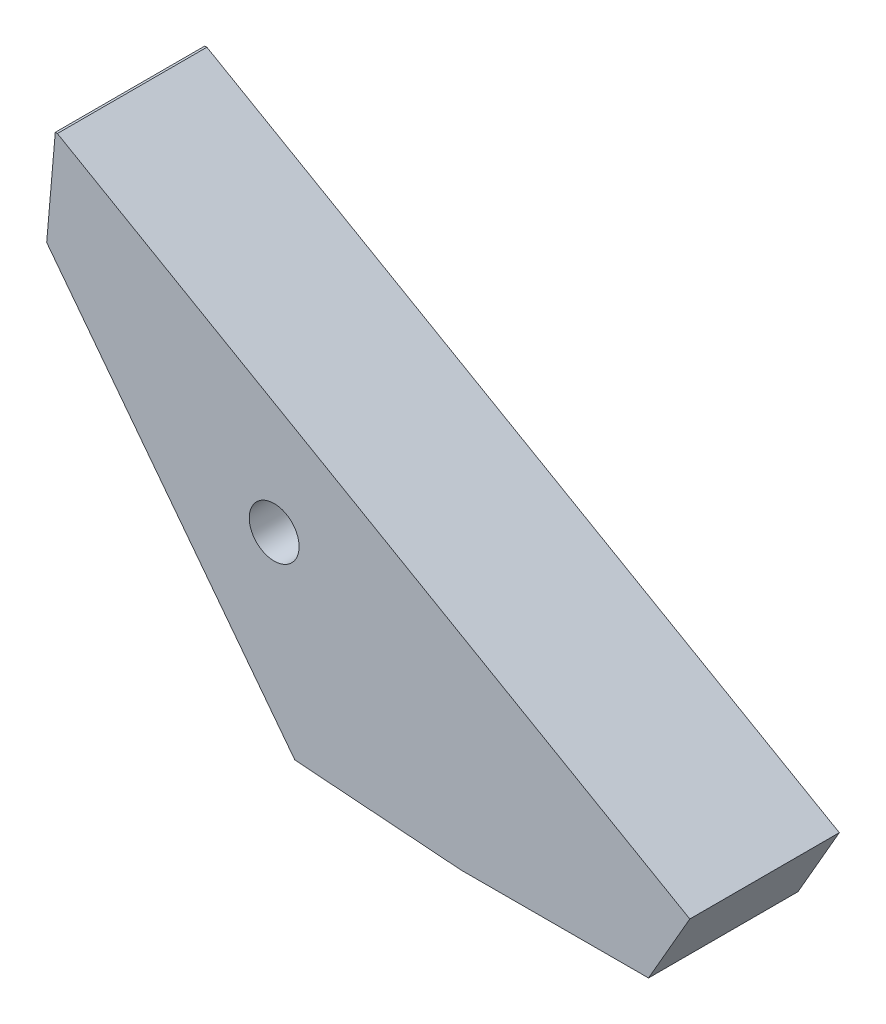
ISO-10303-21;
HEADER;
FILE_DESCRIPTION(('STEP AP214'),'2;1');
FILE_NAME('part.step','',(''),(''),'','','');
FILE_SCHEMA(('AUTOMOTIVE_DESIGN { 1 0 10303 214 1 1 1 1 }'));
ENDSEC;
DATA;
#1=APPLICATION_CONTEXT('core data for automotive mechanical design processes');
#2=APPLICATION_PROTOCOL_DEFINITION('international standard','automotive_design',2000,#1);
#3=PRODUCT_CONTEXT('',#1,'mechanical');
#4=PRODUCT('Part','Part','',(#3));
#5=PRODUCT_RELATED_PRODUCT_CATEGORY('part','',(#4));
#6=PRODUCT_DEFINITION_FORMATION('','',#4);
#7=PRODUCT_DEFINITION_CONTEXT('part definition',#1,'design');
#8=PRODUCT_DEFINITION('design','',#6,#7);
#9=PRODUCT_DEFINITION_SHAPE('','',#8);
#10=(LENGTH_UNIT() NAMED_UNIT(*) SI_UNIT(.MILLI.,.METRE.));
#11=(NAMED_UNIT(*) PLANE_ANGLE_UNIT() SI_UNIT($,.RADIAN.));
#12=(NAMED_UNIT(*) SI_UNIT($,.STERADIAN.) SOLID_ANGLE_UNIT());
#13=UNCERTAINTY_MEASURE_WITH_UNIT(LENGTH_MEASURE(1.E-05),#10,'distance_accuracy_value','');
#14=(GEOMETRIC_REPRESENTATION_CONTEXT(3) GLOBAL_UNCERTAINTY_ASSIGNED_CONTEXT((#13)) GLOBAL_UNIT_ASSIGNED_CONTEXT((#10,
#11,#12)) REPRESENTATION_CONTEXT('',''));
#15=CARTESIAN_POINT('',(0.,0.,0.));
#16=DIRECTION('',(0.,0.,1.));
#17=DIRECTION('',(1.,0.,0.));
#18=AXIS2_PLACEMENT_3D('',#15,#16,#17);
#19=CARTESIAN_POINT('',(-87.8467703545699,95.0748547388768,-30.));
#20=DIRECTION('',(0.,1.,0.));
#21=DIRECTION('',(0.,0.,1.));
#22=AXIS2_PLACEMENT_3D('',#19,#20,#21);
#23=PLANE('',#22);
#24=DIRECTION('',(0.,0.,1.));
#25=VECTOR('',#24,1.);
#26=CARTESIAN_POINT('',(-87.8467703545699,95.0748547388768,-30.));
#27=LINE('',#26,#25);
#28=CARTESIAN_POINT('',(-87.8467703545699,95.0748547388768,-30.));
#29=VERTEX_POINT('',#28);
#30=CARTESIAN_POINT('',(-87.8467703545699,95.0748547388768,30.));
#31=VERTEX_POINT('',#30);
#32=EDGE_CURVE('E34',#29,#31,#27,.T.);
#33=ORIENTED_EDGE('',*,*,#32,.T.);
#34=DIRECTION('',(-1.,0.,0.));
#35=VECTOR('',#34,1.);
#36=CARTESIAN_POINT('',(-87.8467703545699,95.0748547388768,30.));
#37=LINE('',#36,#35);
#38=CARTESIAN_POINT('',(-87.0060329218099,95.0748547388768,30.));
#39=VERTEX_POINT('',#38);
#40=EDGE_CURVE('E89',#39,#31,#37,.T.);
#41=ORIENTED_EDGE('',*,*,#40,.F.);
#42=DIRECTION('',(0.,0.,1.));
#43=VECTOR('',#42,1.);
#44=CARTESIAN_POINT('',(-87.0060329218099,95.0748547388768,-30.));
#45=LINE('',#44,#43);
#46=CARTESIAN_POINT('',(-87.0060329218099,95.0748547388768,-30.));
#47=VERTEX_POINT('',#46);
#48=EDGE_CURVE('E11',#47,#39,#45,.T.);
#49=ORIENTED_EDGE('',*,*,#48,.F.);
#50=DIRECTION('',(-1.,0.,0.));
#51=VECTOR('',#50,1.);
#52=CARTESIAN_POINT('',(-87.8467703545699,95.0748547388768,-30.));
#53=LINE('',#52,#51);
#54=EDGE_CURVE('E90',#47,#29,#53,.T.);
#55=ORIENTED_EDGE('',*,*,#54,.T.);
#56=EDGE_LOOP('',(#33,#41,#49,#55));
#57=FACE_BOUND('',#56,.T.);
#58=ADVANCED_FACE('F31',(#57),#23,.T.);
#59=CARTESIAN_POINT('',(-87.0060329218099,95.0748547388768,-30.));
#60=DIRECTION('',(0.49883100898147,0.866699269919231,0.));
#61=DIRECTION('',(-0.866699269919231,0.49883100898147,0.));
#62=AXIS2_PLACEMENT_3D('',#59,#60,#61);
#63=PLANE('',#62);
#64=ORIENTED_EDGE('',*,*,#48,.T.);
#65=DIRECTION('',(-0.866699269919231,0.49883100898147,0.));
#66=VECTOR('',#65,1.);
#67=CARTESIAN_POINT('',(-87.0060329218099,95.0748547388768,30.));
#68=LINE('',#67,#66);
#69=CARTESIAN_POINT('',(166.793285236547,-51.,30.));
#70=VERTEX_POINT('',#69);
#71=EDGE_CURVE('E108',#70,#39,#68,.T.);
#72=ORIENTED_EDGE('',*,*,#71,.F.);
#73=DIRECTION('',(0.,0.,1.));
#74=VECTOR('',#73,1.);
#75=CARTESIAN_POINT('',(166.793285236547,-51.,-30.));
#76=LINE('',#75,#74);
#77=CARTESIAN_POINT('',(166.793285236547,-51.,-30.));
#78=VERTEX_POINT('',#77);
#79=EDGE_CURVE('E39',#78,#70,#76,.T.);
#80=ORIENTED_EDGE('',*,*,#79,.F.);
#81=DIRECTION('',(-0.866699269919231,0.49883100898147,0.));
#82=VECTOR('',#81,1.);
#83=CARTESIAN_POINT('',(-87.0060329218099,95.0748547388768,-30.));
#84=LINE('',#83,#82);
#85=EDGE_CURVE('E94',#78,#47,#84,.T.);
#86=ORIENTED_EDGE('',*,*,#85,.T.);
#87=EDGE_LOOP('',(#64,#72,#80,#86));
#88=FACE_BOUND('',#87,.T.);
#89=ADVANCED_FACE('F166',(#88),#63,.T.);
#90=CARTESIAN_POINT('',(166.793285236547,-51.,-30.));
#91=DIRECTION('',(0.866699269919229,-0.498831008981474,0.));
#92=DIRECTION('',(0.498831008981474,0.866699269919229,0.));
#93=AXIS2_PLACEMENT_3D('',#90,#91,#92);
#94=PLANE('',#93);
#95=ORIENTED_EDGE('',*,*,#79,.T.);
#96=DIRECTION('',(0.498831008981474,0.866699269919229,0.));
#97=VECTOR('',#96,1.);
#98=CARTESIAN_POINT('',(166.793285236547,-51.,30.));
#99=LINE('',#98,#97);
#100=CARTESIAN_POINT('',(150.218878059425,-79.7973809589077,30.));
#101=VERTEX_POINT('',#100);
#102=EDGE_CURVE('E121',#101,#70,#99,.T.);
#103=ORIENTED_EDGE('',*,*,#102,.F.);
#104=DIRECTION('',(0.,0.,1.));
#105=VECTOR('',#104,1.);
#106=CARTESIAN_POINT('',(150.218878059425,-79.7973809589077,-30.));
#107=LINE('',#106,#105);
#108=CARTESIAN_POINT('',(150.218878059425,-79.7973809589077,-30.));
#109=VERTEX_POINT('',#108);
#110=EDGE_CURVE('E143',#109,#101,#107,.T.);
#111=ORIENTED_EDGE('',*,*,#110,.F.);
#112=DIRECTION('',(0.498831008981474,0.866699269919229,0.));
#113=VECTOR('',#112,1.);
#114=CARTESIAN_POINT('',(166.793285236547,-51.,-30.));
#115=LINE('',#114,#113);
#116=EDGE_CURVE('E139',#109,#78,#115,.T.);
#117=ORIENTED_EDGE('',*,*,#116,.T.);
#118=EDGE_LOOP('',(#95,#103,#111,#117));
#119=FACE_BOUND('',#118,.T.);
#120=ADVANCED_FACE('F164',(#119),#94,.T.);
#121=CARTESIAN_POINT('',(150.218878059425,-79.7973809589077,-30.));
#122=DIRECTION('',(0.0013493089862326,-0.999999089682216,0.));
#123=DIRECTION('',(0.999999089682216,0.0013493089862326,0.));
#124=AXIS2_PLACEMENT_3D('',#121,#122,#123);
#125=PLANE('',#124);
#126=ORIENTED_EDGE('',*,*,#110,.T.);
#127=DIRECTION('',(0.999999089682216,0.0013493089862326,0.));
#128=VECTOR('',#127,1.);
#129=CARTESIAN_POINT('',(150.218878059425,-79.7973809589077,30.));
#130=LINE('',#129,#128);
#131=CARTESIAN_POINT('',(75.,-79.898874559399,30.));
#132=VERTEX_POINT('',#131);
#133=EDGE_CURVE('E118',#132,#101,#130,.T.);
#134=ORIENTED_EDGE('',*,*,#133,.F.);
#135=DIRECTION('',(0.,0.,1.));
#136=VECTOR('',#135,1.);
#137=CARTESIAN_POINT('',(75.,-79.898874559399,-30.));
#138=LINE('',#137,#136);
#139=CARTESIAN_POINT('',(75.,-79.898874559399,-30.));
#140=VERTEX_POINT('',#139);
#141=EDGE_CURVE('E145',#140,#132,#138,.T.);
#142=ORIENTED_EDGE('',*,*,#141,.F.);
#143=DIRECTION('',(0.999999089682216,0.0013493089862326,0.));
#144=VECTOR('',#143,1.);
#145=CARTESIAN_POINT('',(150.218878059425,-79.7973809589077,-30.));
#146=LINE('',#145,#144);
#147=EDGE_CURVE('E136',#140,#109,#146,.T.);
#148=ORIENTED_EDGE('',*,*,#147,.T.);
#149=EDGE_LOOP('',(#126,#134,#142,#148));
#150=FACE_BOUND('',#149,.T.);
#151=ADVANCED_FACE('F158',(#150),#125,.T.);
#152=CARTESIAN_POINT('',(8.30000000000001,-74.9888689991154,-30.));
#153=DIRECTION('',(-0.0734146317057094,-0.997301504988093,0.));
#154=DIRECTION('',(0.997301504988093,-0.0734146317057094,0.));
#155=AXIS2_PLACEMENT_3D('',#152,#153,#154);
#156=PLANE('',#155);
#157=ORIENTED_EDGE('',*,*,#141,.T.);
#158=DIRECTION('',(0.997301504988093,-0.0734146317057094,0.));
#159=VECTOR('',#158,1.);
#160=CARTESIAN_POINT('',(8.30000000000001,-74.9888689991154,30.));
#161=LINE('',#160,#159);
#162=CARTESIAN_POINT('',(8.30000000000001,-74.9888689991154,30.));
#163=VERTEX_POINT('',#162);
#164=EDGE_CURVE('E115',#163,#132,#161,.T.);
#165=ORIENTED_EDGE('',*,*,#164,.F.);
#166=DIRECTION('',(0.,0.,1.));
#167=VECTOR('',#166,1.);
#168=CARTESIAN_POINT('',(8.30000000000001,-74.9888689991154,-30.));
#169=LINE('',#168,#167);
#170=CARTESIAN_POINT('',(8.30000000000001,-74.9888689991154,-30.));
#171=VERTEX_POINT('',#170);
#172=EDGE_CURVE('E147',#171,#163,#169,.T.);
#173=ORIENTED_EDGE('',*,*,#172,.F.);
#174=DIRECTION('',(0.997301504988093,-0.0734146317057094,0.));
#175=VECTOR('',#174,1.);
#176=CARTESIAN_POINT('',(8.30000000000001,-74.9888689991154,-30.));
#177=LINE('',#176,#175);
#178=EDGE_CURVE('E133',#171,#140,#177,.T.);
#179=ORIENTED_EDGE('',*,*,#178,.T.);
#180=EDGE_LOOP('',(#157,#165,#173,#179));
#181=FACE_BOUND('',#180,.T.);
#182=ADVANCED_FACE('F155',(#181),#156,.T.);
#183=CARTESIAN_POINT('',(-91.2919377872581,55.0748547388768,-30.));
#184=DIRECTION('',(-0.7939704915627,-0.607956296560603,0.));
#185=DIRECTION('',(0.607956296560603,-0.7939704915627,0.));
#186=AXIS2_PLACEMENT_3D('',#183,#184,#185);
#187=PLANE('',#186);
#188=ORIENTED_EDGE('',*,*,#172,.T.);
#189=DIRECTION('',(0.607956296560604,-0.7939704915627,0.));
#190=VECTOR('',#189,1.);
#191=CARTESIAN_POINT('',(-91.2919377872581,55.0748547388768,30.));
#192=LINE('',#191,#190);
#193=CARTESIAN_POINT('',(-91.2919377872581,55.0748547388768,30.));
#194=VERTEX_POINT('',#193);
#195=EDGE_CURVE('E102',#194,#163,#192,.T.);
#196=ORIENTED_EDGE('',*,*,#195,.F.);
#197=DIRECTION('',(0.,0.,1.));
#198=VECTOR('',#197,1.);
#199=CARTESIAN_POINT('',(-91.2919377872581,55.0748547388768,-30.));
#200=LINE('',#199,#198);
#201=CARTESIAN_POINT('',(-91.2919377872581,55.0748547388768,-30.));
#202=VERTEX_POINT('',#201);
#203=EDGE_CURVE('E93',#202,#194,#200,.T.);
#204=ORIENTED_EDGE('',*,*,#203,.F.);
#205=DIRECTION('',(0.607956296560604,-0.7939704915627,0.));
#206=VECTOR('',#205,1.);
#207=CARTESIAN_POINT('',(-91.2919377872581,55.0748547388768,-30.));
#208=LINE('',#207,#206);
#209=EDGE_CURVE('E130',#202,#171,#208,.T.);
#210=ORIENTED_EDGE('',*,*,#209,.T.);
#211=EDGE_LOOP('',(#188,#196,#204,#210));
#212=FACE_BOUND('',#211,.T.);
#213=ADVANCED_FACE('F149',(#212),#187,.T.);
#214=CARTESIAN_POINT('',(-91.2919377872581,55.0748547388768,-30.));
#215=DIRECTION('',(-0.996311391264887,0.0858114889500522,0.));
#216=DIRECTION('',(-0.0858114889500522,-0.996311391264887,0.));
#217=AXIS2_PLACEMENT_3D('',#214,#215,#216);
#218=PLANE('',#217);
#219=ORIENTED_EDGE('',*,*,#203,.T.);
#220=DIRECTION('',(-0.0858114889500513,-0.996311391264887,0.));
#221=VECTOR('',#220,1.);
#222=CARTESIAN_POINT('',(-90.,70.0748547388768,30.));
#223=LINE('',#222,#221);
#224=EDGE_CURVE('E96',#31,#194,#223,.T.);
#225=ORIENTED_EDGE('',*,*,#224,.F.);
#226=ORIENTED_EDGE('',*,*,#32,.F.);
#227=DIRECTION('',(-0.0858114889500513,-0.996311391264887,0.));
#228=VECTOR('',#227,1.);
#229=CARTESIAN_POINT('',(-90.,70.0748547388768,-30.));
#230=LINE('',#229,#228);
#231=EDGE_CURVE('E128',#29,#202,#230,.T.);
#232=ORIENTED_EDGE('',*,*,#231,.T.);
#233=EDGE_LOOP('',(#219,#225,#226,#232));
#234=FACE_BOUND('',#233,.T.);
#235=ADVANCED_FACE('F97',(#234),#218,.T.);
#236=CARTESIAN_POINT('',(-87.8467703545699,95.0748547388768,-30.));
#237=DIRECTION('',(0.,0.,1.));
#238=DIRECTION('',(1.,0.,0.));
#239=AXIS2_PLACEMENT_3D('',#236,#237,#238);
#240=PLANE('',#239);
#241=CARTESIAN_POINT('',(0.,0.,-30.));
#242=DIRECTION('',(0.,0.,1.));
#243=DIRECTION('',(1.,0.,0.));
#244=AXIS2_PLACEMENT_3D('',#241,#242,#243);
#245=CIRCLE('',#244,10.);
#246=CARTESIAN_POINT('',(10.,0.,-30.));
#247=VERTEX_POINT('',#246);
#248=EDGE_CURVE('E124',#247,#247,#245,.T.);
#249=ORIENTED_EDGE('',*,*,#248,.T.);
#250=EDGE_LOOP('',(#249));
#251=FACE_BOUND('',#250,.T.);
#252=ORIENTED_EDGE('',*,*,#54,.F.);
#253=ORIENTED_EDGE('',*,*,#85,.F.);
#254=ORIENTED_EDGE('',*,*,#116,.F.);
#255=ORIENTED_EDGE('',*,*,#147,.F.);
#256=ORIENTED_EDGE('',*,*,#178,.F.);
#257=ORIENTED_EDGE('',*,*,#209,.F.);
#258=ORIENTED_EDGE('',*,*,#231,.F.);
#259=EDGE_LOOP('',(#252,#253,#254,#255,#256,#257,#258));
#260=FACE_BOUND('',#259,.T.);
#261=ADVANCED_FACE('F161',(#251,#260),#240,.F.);
#262=CARTESIAN_POINT('',(0.,0.,-30.));
#263=DIRECTION('',(0.,0.,1.));
#264=DIRECTION('',(1.,0.,0.));
#265=AXIS2_PLACEMENT_3D('',#262,#263,#264);
#266=CYLINDRICAL_SURFACE('',#265,10.);
#267=ORIENTED_EDGE('',*,*,#248,.F.);
#268=EDGE_LOOP('',(#267));
#269=FACE_BOUND('',#268,.T.);
#270=CARTESIAN_POINT('',(0.,0.,30.));
#271=DIRECTION('',(0.,0.,1.));
#272=DIRECTION('',(1.,0.,0.));
#273=AXIS2_PLACEMENT_3D('',#270,#271,#272);
#274=CIRCLE('',#273,10.);
#275=CARTESIAN_POINT('',(10.,0.,30.));
#276=VERTEX_POINT('',#275);
#277=EDGE_CURVE('E109',#276,#276,#274,.T.);
#278=ORIENTED_EDGE('',*,*,#277,.T.);
#279=EDGE_LOOP('',(#278));
#280=FACE_BOUND('',#279,.T.);
#281=ADVANCED_FACE('F186',(#269,#280),#266,.F.);
#282=CARTESIAN_POINT('',(-87.8467703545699,95.0748547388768,30.));
#283=DIRECTION('',(0.,0.,1.));
#284=DIRECTION('',(1.,0.,0.));
#285=AXIS2_PLACEMENT_3D('',#282,#283,#284);
#286=PLANE('',#285);
#287=ORIENTED_EDGE('',*,*,#40,.T.);
#288=ORIENTED_EDGE('',*,*,#224,.T.);
#289=ORIENTED_EDGE('',*,*,#195,.T.);
#290=ORIENTED_EDGE('',*,*,#164,.T.);
#291=ORIENTED_EDGE('',*,*,#133,.T.);
#292=ORIENTED_EDGE('',*,*,#102,.T.);
#293=ORIENTED_EDGE('',*,*,#71,.T.);
#294=EDGE_LOOP('',(#287,#288,#289,#290,#291,#292,#293));
#295=FACE_BOUND('',#294,.T.);
#296=ORIENTED_EDGE('',*,*,#277,.F.);
#297=EDGE_LOOP('',(#296));
#298=FACE_BOUND('',#297,.T.);
#299=ADVANCED_FACE('F105',(#295,#298),#286,.T.);
#300=CLOSED_SHELL('',(#58,#89,#120,#151,#182,#213,#235,#261,#281,#299));
#301=MANIFOLD_SOLID_BREP('B2',#300);
#302=ADVANCED_BREP_SHAPE_REPRESENTATION('',(#18,#301),#14);
#303=SHAPE_DEFINITION_REPRESENTATION(#9,#302);
ENDSEC;
END-ISO-10303-21;
